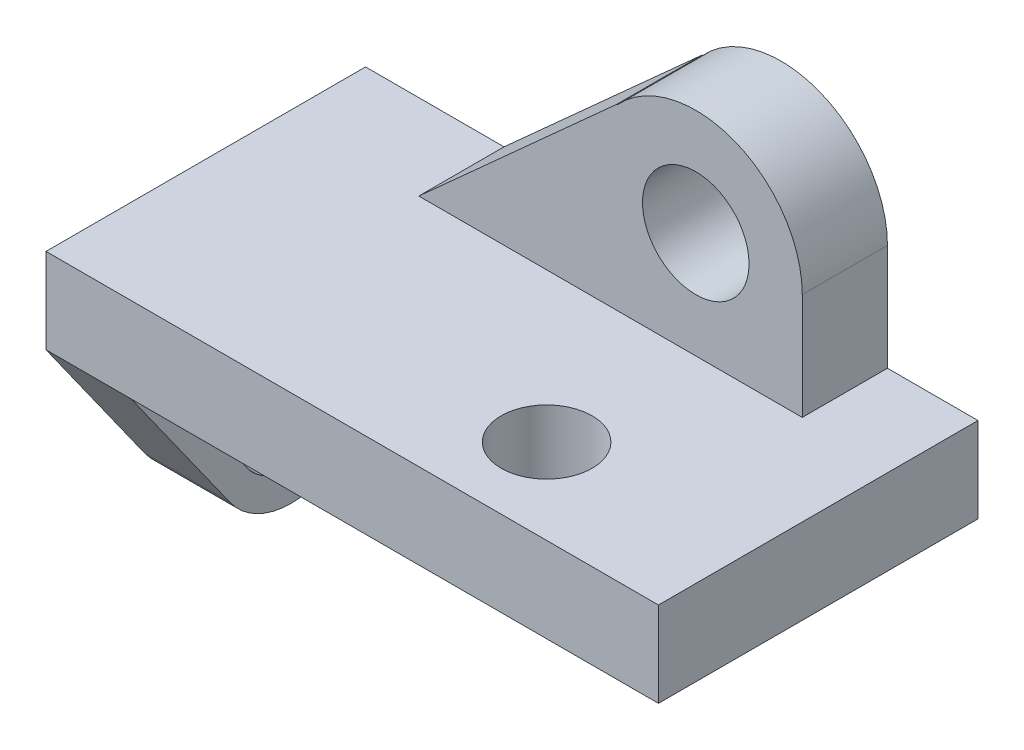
ISO-10303-21;
HEADER;
FILE_DESCRIPTION(('STEP AP214'),'2;1');
FILE_NAME('part.step','',(''),(''),'','','');
FILE_SCHEMA(('AUTOMOTIVE_DESIGN { 1 0 10303 214 1 1 1 1 }'));
ENDSEC;
DATA;
#1=APPLICATION_CONTEXT('core data for automotive mechanical design processes');
#2=APPLICATION_PROTOCOL_DEFINITION('international standard','automotive_design',2000,#1);
#3=PRODUCT_CONTEXT('',#1,'mechanical');
#4=PRODUCT('Part','Part','',(#3));
#5=PRODUCT_RELATED_PRODUCT_CATEGORY('part','',(#4));
#6=PRODUCT_DEFINITION_FORMATION('','',#4);
#7=PRODUCT_DEFINITION_CONTEXT('part definition',#1,'design');
#8=PRODUCT_DEFINITION('design','',#6,#7);
#9=PRODUCT_DEFINITION_SHAPE('','',#8);
#10=(LENGTH_UNIT() NAMED_UNIT(*) SI_UNIT(.MILLI.,.METRE.));
#11=(NAMED_UNIT(*) PLANE_ANGLE_UNIT() SI_UNIT($,.RADIAN.));
#12=(NAMED_UNIT(*) SI_UNIT($,.STERADIAN.) SOLID_ANGLE_UNIT());
#13=UNCERTAINTY_MEASURE_WITH_UNIT(LENGTH_MEASURE(1.E-05),#10,'distance_accuracy_value','');
#14=(GEOMETRIC_REPRESENTATION_CONTEXT(3) GLOBAL_UNCERTAINTY_ASSIGNED_CONTEXT((#13)) GLOBAL_UNIT_ASSIGNED_CONTEXT((#10,
#11,#12)) REPRESENTATION_CONTEXT('',''));
#15=CARTESIAN_POINT('',(0.,0.,0.));
#16=DIRECTION('',(0.,0.,1.));
#17=DIRECTION('',(1.,0.,0.));
#18=AXIS2_PLACEMENT_3D('',#15,#16,#17);
#19=CARTESIAN_POINT('',(-156.,32.,-60.));
#20=DIRECTION('',(1.,0.,0.));
#21=DIRECTION('',(0.,0.,-1.));
#22=AXIS2_PLACEMENT_3D('',#19,#20,#21);
#23=PLANE('',#22);
#24=DIRECTION('',(0.,-1.,0.));
#25=VECTOR('',#24,1.);
#26=CARTESIAN_POINT('',(-156.,32.,-60.));
#27=LINE('',#26,#25);
#28=CARTESIAN_POINT('',(-156.,32.,-60.));
#29=VERTEX_POINT('',#28);
#30=CARTESIAN_POINT('',(-156.,0.,-60.));
#31=VERTEX_POINT('',#30);
#32=EDGE_CURVE('E192',#29,#31,#27,.T.);
#33=ORIENTED_EDGE('',*,*,#32,.T.);
#34=DIRECTION('',(0.,-0.815119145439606,0.579293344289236));
#35=VECTOR('',#34,1.);
#36=CARTESIAN_POINT('',(-156.,-52.1676253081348,-22.9252259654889));
#37=LINE('',#36,#35);
#38=CARTESIAN_POINT('',(-156.,-52.1676253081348,-22.9252259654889));
#39=VERTEX_POINT('',#38);
#40=EDGE_CURVE('E445',#31,#39,#37,.T.);
#41=ORIENTED_EDGE('',*,*,#40,.T.);
#42=CARTESIAN_POINT('',(-156.,-35.875,0.));
#43=DIRECTION('',(-1.,0.,0.));
#44=DIRECTION('',(0.,0.,-1.));
#45=AXIS2_PLACEMENT_3D('',#42,#43,#44);
#46=CIRCLE('',#45,28.125);
#47=CARTESIAN_POINT('',(-156.,-52.1676253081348,22.9252259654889));
#48=VERTEX_POINT('',#47);
#49=EDGE_CURVE('E128',#39,#48,#46,.T.);
#50=ORIENTED_EDGE('',*,*,#49,.T.);
#51=DIRECTION('',(0.,0.815119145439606,0.579293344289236));
#52=VECTOR('',#51,1.);
#53=CARTESIAN_POINT('',(-156.,0.,60.));
#54=LINE('',#53,#52);
#55=CARTESIAN_POINT('',(-156.,0.,60.));
#56=VERTEX_POINT('',#55);
#57=EDGE_CURVE('E142',#48,#56,#54,.T.);
#58=ORIENTED_EDGE('',*,*,#57,.T.);
#59=DIRECTION('',(0.,-1.,0.));
#60=VECTOR('',#59,1.);
#61=CARTESIAN_POINT('',(-156.,32.,60.));
#62=LINE('',#61,#60);
#63=CARTESIAN_POINT('',(-156.,32.,60.));
#64=VERTEX_POINT('',#63);
#65=EDGE_CURVE('E11',#64,#56,#62,.T.);
#66=ORIENTED_EDGE('',*,*,#65,.F.);
#67=DIRECTION('',(0.,0.,1.));
#68=VECTOR('',#67,1.);
#69=CARTESIAN_POINT('',(-156.,32.,-60.));
#70=LINE('',#69,#68);
#71=EDGE_CURVE('E176',#29,#64,#70,.T.);
#72=ORIENTED_EDGE('',*,*,#71,.F.);
#73=EDGE_LOOP('',(#33,#41,#50,#58,#66,#72));
#74=FACE_BOUND('',#73,.T.);
#75=CARTESIAN_POINT('',(-156.,-32.,0.));
#76=DIRECTION('',(-1.,0.,0.));
#77=DIRECTION('',(0.,0.,1.));
#78=AXIS2_PLACEMENT_3D('',#75,#76,#77);
#79=CIRCLE('',#78,20.5525797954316);
#80=CARTESIAN_POINT('',(-156.,-32.,20.5525797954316));
#81=VERTEX_POINT('',#80);
#82=EDGE_CURVE('E438',#81,#81,#79,.T.);
#83=ORIENTED_EDGE('',*,*,#82,.F.);
#84=EDGE_LOOP('',(#83));
#85=FACE_BOUND('',#84,.T.);
#86=ADVANCED_FACE('F31',(#74,#85),#23,.F.);
#87=CARTESIAN_POINT('',(-156.,32.,60.));
#88=DIRECTION('',(0.,0.,-1.));
#89=DIRECTION('',(-1.,0.,0.));
#90=AXIS2_PLACEMENT_3D('',#87,#88,#89);
#91=PLANE('',#90);
#92=DIRECTION('',(1.,0.,0.));
#93=VECTOR('',#92,1.);
#94=CARTESIAN_POINT('',(-156.,0.,60.));
#95=LINE('',#94,#93);
#96=CARTESIAN_POINT('',(-124.,0.,60.));
#97=VERTEX_POINT('',#96);
#98=EDGE_CURVE('E182',#56,#97,#95,.T.);
#99=ORIENTED_EDGE('',*,*,#98,.T.);
#100=CARTESIAN_POINT('',(74.,0.,60.));
#101=VERTEX_POINT('',#100);
#102=EDGE_CURVE('E165',#97,#101,#95,.T.);
#103=ORIENTED_EDGE('',*,*,#102,.T.);
#104=DIRECTION('',(0.,-1.,0.));
#105=VECTOR('',#104,1.);
#106=CARTESIAN_POINT('',(74.,32.,60.));
#107=LINE('',#106,#105);
#108=CARTESIAN_POINT('',(74.,32.,60.));
#109=VERTEX_POINT('',#108);
#110=EDGE_CURVE('E39',#109,#101,#107,.T.);
#111=ORIENTED_EDGE('',*,*,#110,.F.);
#112=DIRECTION('',(1.,0.,0.));
#113=VECTOR('',#112,1.);
#114=CARTESIAN_POINT('',(-156.,32.,60.));
#115=LINE('',#114,#113);
#116=EDGE_CURVE('E180',#64,#109,#115,.T.);
#117=ORIENTED_EDGE('',*,*,#116,.F.);
#118=ORIENTED_EDGE('',*,*,#65,.T.);
#119=EDGE_LOOP('',(#99,#103,#111,#117,#118));
#120=FACE_BOUND('',#119,.T.);
#121=ADVANCED_FACE('F235',(#120),#91,.F.);
#122=CARTESIAN_POINT('',(74.,32.,-60.));
#123=DIRECTION('',(-1.,0.,0.));
#124=DIRECTION('',(0.,0.,1.));
#125=AXIS2_PLACEMENT_3D('',#122,#123,#124);
#126=PLANE('',#125);
#127=DIRECTION('',(0.,0.,-1.));
#128=VECTOR('',#127,1.);
#129=CARTESIAN_POINT('',(74.,0.,-60.));
#130=LINE('',#129,#128);
#131=CARTESIAN_POINT('',(74.,0.,-60.));
#132=VERTEX_POINT('',#131);
#133=EDGE_CURVE('E177',#101,#132,#130,.T.);
#134=ORIENTED_EDGE('',*,*,#133,.T.);
#135=DIRECTION('',(0.,-1.,0.));
#136=VECTOR('',#135,1.);
#137=CARTESIAN_POINT('',(74.,32.,-60.));
#138=LINE('',#137,#136);
#139=CARTESIAN_POINT('',(74.,32.,-60.));
#140=VERTEX_POINT('',#139);
#141=EDGE_CURVE('E175',#140,#132,#138,.T.);
#142=ORIENTED_EDGE('',*,*,#141,.F.);
#143=DIRECTION('',(0.,0.,-1.));
#144=VECTOR('',#143,1.);
#145=CARTESIAN_POINT('',(74.,32.,-60.));
#146=LINE('',#145,#144);
#147=EDGE_CURVE('E205',#109,#140,#146,.T.);
#148=ORIENTED_EDGE('',*,*,#147,.F.);
#149=ORIENTED_EDGE('',*,*,#110,.T.);
#150=EDGE_LOOP('',(#134,#142,#148,#149));
#151=FACE_BOUND('',#150,.T.);
#152=ADVANCED_FACE('F237',(#151),#126,.F.);
#153=CARTESIAN_POINT('',(-156.,32.,-60.));
#154=DIRECTION('',(0.,0.,1.));
#155=DIRECTION('',(1.,0.,0.));
#156=AXIS2_PLACEMENT_3D('',#153,#154,#155);
#157=PLANE('',#156);
#158=DIRECTION('',(-1.,0.,0.));
#159=VECTOR('',#158,1.);
#160=CARTESIAN_POINT('',(-156.,0.,-60.));
#161=LINE('',#160,#159);
#162=CARTESIAN_POINT('',(-124.,0.,-60.));
#163=VERTEX_POINT('',#162);
#164=EDGE_CURVE('E164',#132,#163,#161,.T.);
#165=ORIENTED_EDGE('',*,*,#164,.T.);
#166=DIRECTION('',(-1.,0.,0.));
#167=VECTOR('',#166,1.);
#168=CARTESIAN_POINT('',(-124.,0.,-60.));
#169=LINE('',#168,#167);
#170=EDGE_CURVE('E140',#163,#31,#169,.T.);
#171=ORIENTED_EDGE('',*,*,#170,.T.);
#172=ORIENTED_EDGE('',*,*,#32,.F.);
#173=DIRECTION('',(-1.,0.,0.));
#174=VECTOR('',#173,1.);
#175=CARTESIAN_POINT('',(-156.,32.,-60.));
#176=LINE('',#175,#174);
#177=CARTESIAN_POINT('',(-104.,32.,-60.));
#178=VERTEX_POINT('',#177);
#179=EDGE_CURVE('E201',#178,#29,#176,.T.);
#180=ORIENTED_EDGE('',*,*,#179,.F.);
#181=DIRECTION('',(-0.742771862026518,-0.669544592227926,0.));
#182=VECTOR('',#181,1.);
#183=CARTESIAN_POINT('',(-109.239378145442,27.2771537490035,-60.));
#184=LINE('',#183,#182);
#185=CARTESIAN_POINT('',(-29.6901707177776,98.9838841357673,-60.));
#186=VERTEX_POINT('',#185);
#187=EDGE_CURVE('E55',#186,#178,#184,.T.);
#188=ORIENTED_EDGE('',*,*,#187,.F.);
#189=DIRECTION('',(1.,0.,0.));
#190=VECTOR('',#189,1.);
#191=CARTESIAN_POINT('',(-29.4075769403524,98.9838841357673,-60.));
#192=LINE('',#191,#190);
#193=CARTESIAN_POINT('',(-29.4257279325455,98.9838841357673,-60.));
#194=VERTEX_POINT('',#193);
#195=EDGE_CURVE('E253',#186,#194,#192,.T.);
#196=ORIENTED_EDGE('',*,*,#195,.T.);
#197=CARTESIAN_POINT('',(0.0175364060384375,71.9340859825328,-60.));
#198=DIRECTION('',(0.,0.,1.));
#199=DIRECTION('',(1.,0.,0.));
#200=AXIS2_PLACEMENT_3D('',#197,#198,#199);
#201=CIRCLE('',#200,39.9824635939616);
#202=CARTESIAN_POINT('',(40.,71.9340859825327,-60.));
#203=VERTEX_POINT('',#202);
#204=EDGE_CURVE('E252',#203,#194,#201,.T.);
#205=ORIENTED_EDGE('',*,*,#204,.F.);
#206=DIRECTION('',(0.,1.,0.));
#207=VECTOR('',#206,1.);
#208=CARTESIAN_POINT('',(40.,-61.2857535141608,-60.));
#209=LINE('',#208,#207);
#210=CARTESIAN_POINT('',(40.,32.,-60.));
#211=VERTEX_POINT('',#210);
#212=EDGE_CURVE('E239',#211,#203,#209,.T.);
#213=ORIENTED_EDGE('',*,*,#212,.F.);
#214=EDGE_CURVE('E194',#140,#211,#176,.T.);
#215=ORIENTED_EDGE('',*,*,#214,.F.);
#216=ORIENTED_EDGE('',*,*,#141,.T.);
#217=EDGE_LOOP('',(#165,#171,#172,#180,#188,#196,#205,#213,#215,#216));
#218=FACE_BOUND('',#217,.T.);
#219=CARTESIAN_POINT('',(0.0175364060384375,71.9340859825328,-60.));
#220=DIRECTION('',(0.,0.,1.));
#221=DIRECTION('',(1.,0.,0.));
#222=AXIS2_PLACEMENT_3D('',#219,#220,#221);
#223=CIRCLE('',#222,20.);
#224=CARTESIAN_POINT('',(20.0175364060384,71.9340859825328,-60.));
#225=VERTEX_POINT('',#224);
#226=EDGE_CURVE('E153',#225,#225,#223,.T.);
#227=ORIENTED_EDGE('',*,*,#226,.T.);
#228=EDGE_LOOP('',(#227));
#229=FACE_BOUND('',#228,.T.);
#230=ADVANCED_FACE('F169',(#218,#229),#157,.F.);
#231=CARTESIAN_POINT('',(-156.,32.,60.));
#232=DIRECTION('',(0.,1.,0.));
#233=DIRECTION('',(0.,0.,1.));
#234=AXIS2_PLACEMENT_3D('',#231,#232,#233);
#235=PLANE('',#234);
#236=CARTESIAN_POINT('',(0.,32.,28.));
#237=DIRECTION('',(0.,1.,0.));
#238=DIRECTION('',(0.,0.,1.));
#239=AXIS2_PLACEMENT_3D('',#236,#237,#238);
#240=CIRCLE('',#239,17.0810187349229);
#241=CARTESIAN_POINT('',(0.,32.,45.0810187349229));
#242=VERTEX_POINT('',#241);
#243=EDGE_CURVE('E435',#242,#242,#240,.T.);
#244=ORIENTED_EDGE('',*,*,#243,.F.);
#245=EDGE_LOOP('',(#244));
#246=FACE_BOUND('',#245,.T.);
#247=DIRECTION('',(0.,0.,-1.));
#248=VECTOR('',#247,1.);
#249=CARTESIAN_POINT('',(40.,32.,-28.));
#250=LINE('',#249,#248);
#251=CARTESIAN_POINT('',(40.,32.,-28.));
#252=VERTEX_POINT('',#251);
#253=EDGE_CURVE('E240',#252,#211,#250,.T.);
#254=ORIENTED_EDGE('',*,*,#253,.F.);
#255=DIRECTION('',(1.,0.,0.));
#256=VECTOR('',#255,1.);
#257=CARTESIAN_POINT('',(-29.4075769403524,32.,-28.));
#258=LINE('',#257,#256);
#259=CARTESIAN_POINT('',(-104.,32.,-28.));
#260=VERTEX_POINT('',#259);
#261=EDGE_CURVE('E241',#260,#252,#258,.T.);
#262=ORIENTED_EDGE('',*,*,#261,.F.);
#263=DIRECTION('',(0.,0.,-1.));
#264=VECTOR('',#263,1.);
#265=CARTESIAN_POINT('',(-104.,32.,-28.));
#266=LINE('',#265,#264);
#267=EDGE_CURVE('E231',#260,#178,#266,.T.);
#268=ORIENTED_EDGE('',*,*,#267,.T.);
#269=ORIENTED_EDGE('',*,*,#179,.T.);
#270=ORIENTED_EDGE('',*,*,#71,.T.);
#271=ORIENTED_EDGE('',*,*,#116,.T.);
#272=ORIENTED_EDGE('',*,*,#147,.T.);
#273=ORIENTED_EDGE('',*,*,#214,.T.);
#274=EDGE_LOOP('',(#254,#262,#268,#269,#270,#271,#272,#273));
#275=FACE_BOUND('',#274,.T.);
#276=ADVANCED_FACE('F227',(#246,#275),#235,.T.);
#277=CARTESIAN_POINT('',(-156.,0.,60.));
#278=DIRECTION('',(0.,1.,0.));
#279=DIRECTION('',(0.,0.,1.));
#280=AXIS2_PLACEMENT_3D('',#277,#278,#279);
#281=PLANE('',#280);
#282=CARTESIAN_POINT('',(0.,0.,28.));
#283=DIRECTION('',(0.,1.,0.));
#284=DIRECTION('',(0.,0.,1.));
#285=AXIS2_PLACEMENT_3D('',#282,#283,#284);
#286=CIRCLE('',#285,17.0810187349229);
#287=CARTESIAN_POINT('',(0.,0.,45.0810187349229));
#288=VERTEX_POINT('',#287);
#289=EDGE_CURVE('E34',#288,#288,#286,.T.);
#290=ORIENTED_EDGE('',*,*,#289,.T.);
#291=EDGE_LOOP('',(#290));
#292=FACE_BOUND('',#291,.T.);
#293=ORIENTED_EDGE('',*,*,#102,.F.);
#294=DIRECTION('',(0.,0.,-1.));
#295=VECTOR('',#294,1.);
#296=CARTESIAN_POINT('',(-124.,0.,-60.));
#297=LINE('',#296,#295);
#298=EDGE_CURVE('E132',#97,#163,#297,.T.);
#299=ORIENTED_EDGE('',*,*,#298,.T.);
#300=ORIENTED_EDGE('',*,*,#164,.F.);
#301=ORIENTED_EDGE('',*,*,#133,.F.);
#302=EDGE_LOOP('',(#293,#299,#300,#301));
#303=FACE_BOUND('',#302,.T.);
#304=ADVANCED_FACE('F162',(#292,#303),#281,.F.);
#305=CARTESIAN_POINT('',(40.,-61.2857535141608,-28.));
#306=DIRECTION('',(-1.,0.,0.));
#307=DIRECTION('',(0.,-1.,0.));
#308=AXIS2_PLACEMENT_3D('',#305,#306,#307);
#309=PLANE('',#308);
#310=ORIENTED_EDGE('',*,*,#212,.T.);
#311=DIRECTION('',(0.,0.,-1.));
#312=VECTOR('',#311,1.);
#313=CARTESIAN_POINT('',(40.,71.9340859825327,-28.));
#314=LINE('',#313,#312);
#315=CARTESIAN_POINT('',(40.,71.9340859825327,-28.));
#316=VERTEX_POINT('',#315);
#317=EDGE_CURVE('E211',#316,#203,#314,.T.);
#318=ORIENTED_EDGE('',*,*,#317,.F.);
#319=DIRECTION('',(0.,1.,0.));
#320=VECTOR('',#319,1.);
#321=CARTESIAN_POINT('',(40.,-61.2857535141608,-28.));
#322=LINE('',#321,#320);
#323=EDGE_CURVE('E265',#252,#316,#322,.T.);
#324=ORIENTED_EDGE('',*,*,#323,.F.);
#325=ORIENTED_EDGE('',*,*,#253,.T.);
#326=EDGE_LOOP('',(#310,#318,#324,#325));
#327=FACE_BOUND('',#326,.T.);
#328=ADVANCED_FACE('F308',(#327),#309,.F.);
#329=CARTESIAN_POINT('',(0.0175364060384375,71.9340859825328,-28.));
#330=DIRECTION('',(0.,0.,-1.));
#331=DIRECTION('',(-1.,0.,0.));
#332=AXIS2_PLACEMENT_3D('',#329,#330,#331);
#333=CYLINDRICAL_SURFACE('',#332,39.9824635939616);
#334=ORIENTED_EDGE('',*,*,#204,.T.);
#335=DIRECTION('',(0.,0.,-1.));
#336=VECTOR('',#335,1.);
#337=CARTESIAN_POINT('',(-29.4257279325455,98.9838841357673,-28.));
#338=LINE('',#337,#336);
#339=CARTESIAN_POINT('',(-29.4257279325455,98.9838841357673,-28.));
#340=VERTEX_POINT('',#339);
#341=EDGE_CURVE('E214',#340,#194,#338,.T.);
#342=ORIENTED_EDGE('',*,*,#341,.F.);
#343=CARTESIAN_POINT('',(0.0175364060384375,71.9340859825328,-28.));
#344=DIRECTION('',(0.,0.,1.));
#345=DIRECTION('',(1.,0.,0.));
#346=AXIS2_PLACEMENT_3D('',#343,#344,#345);
#347=CIRCLE('',#346,39.9824635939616);
#348=EDGE_CURVE('E270',#316,#340,#347,.T.);
#349=ORIENTED_EDGE('',*,*,#348,.F.);
#350=ORIENTED_EDGE('',*,*,#317,.T.);
#351=EDGE_LOOP('',(#334,#342,#349,#350));
#352=FACE_BOUND('',#351,.T.);
#353=ADVANCED_FACE('F291',(#352),#333,.T.);
#354=CARTESIAN_POINT('',(-29.4075769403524,98.9838841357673,-28.));
#355=DIRECTION('',(0.,1.,0.));
#356=DIRECTION('',(0.,0.,1.));
#357=AXIS2_PLACEMENT_3D('',#354,#355,#356);
#358=PLANE('',#357);
#359=ORIENTED_EDGE('',*,*,#195,.F.);
#360=DIRECTION('',(0.,0.,-1.));
#361=VECTOR('',#360,1.);
#362=CARTESIAN_POINT('',(-29.6901707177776,98.9838841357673,-28.));
#363=LINE('',#362,#361);
#364=CARTESIAN_POINT('',(-29.6901707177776,98.9838841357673,-28.));
#365=VERTEX_POINT('',#364);
#366=EDGE_CURVE('E220',#365,#186,#363,.T.);
#367=ORIENTED_EDGE('',*,*,#366,.F.);
#368=DIRECTION('',(1.,0.,0.));
#369=VECTOR('',#368,1.);
#370=CARTESIAN_POINT('',(-29.4075769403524,98.9838841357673,-28.));
#371=LINE('',#370,#369);
#372=EDGE_CURVE('E275',#365,#340,#371,.T.);
#373=ORIENTED_EDGE('',*,*,#372,.T.);
#374=ORIENTED_EDGE('',*,*,#341,.T.);
#375=EDGE_LOOP('',(#359,#367,#373,#374));
#376=FACE_BOUND('',#375,.T.);
#377=ADVANCED_FACE('F284',(#376),#358,.T.);
#378=CARTESIAN_POINT('',(-109.239378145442,27.2771537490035,-28.));
#379=DIRECTION('',(0.669544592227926,-0.742771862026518,0.));
#380=DIRECTION('',(0.742771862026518,0.669544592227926,0.));
#381=AXIS2_PLACEMENT_3D('',#378,#379,#380);
#382=PLANE('',#381);
#383=ORIENTED_EDGE('',*,*,#187,.T.);
#384=ORIENTED_EDGE('',*,*,#267,.F.);
#385=DIRECTION('',(-0.742771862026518,-0.669544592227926,0.));
#386=VECTOR('',#385,1.);
#387=CARTESIAN_POINT('',(-109.239378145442,27.2771537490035,-28.));
#388=LINE('',#387,#386);
#389=EDGE_CURVE('E245',#365,#260,#388,.T.);
#390=ORIENTED_EDGE('',*,*,#389,.F.);
#391=ORIENTED_EDGE('',*,*,#366,.T.);
#392=EDGE_LOOP('',(#383,#384,#390,#391));
#393=FACE_BOUND('',#392,.T.);
#394=ADVANCED_FACE('F281',(#393),#382,.F.);
#395=CARTESIAN_POINT('',(0.0175364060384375,71.9340859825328,-28.));
#396=DIRECTION('',(0.,0.,-1.));
#397=DIRECTION('',(-1.,0.,0.));
#398=AXIS2_PLACEMENT_3D('',#395,#396,#397);
#399=CYLINDRICAL_SURFACE('',#398,20.);
#400=CARTESIAN_POINT('',(0.0175364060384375,71.9340859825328,-28.));
#401=DIRECTION('',(0.,0.,1.));
#402=DIRECTION('',(1.,0.,0.));
#403=AXIS2_PLACEMENT_3D('',#400,#401,#402);
#404=CIRCLE('',#403,20.);
#405=CARTESIAN_POINT('',(20.0175364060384,71.9340859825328,-28.));
#406=VERTEX_POINT('',#405);
#407=EDGE_CURVE('E263',#406,#406,#404,.T.);
#408=ORIENTED_EDGE('',*,*,#407,.T.);
#409=EDGE_LOOP('',(#408));
#410=FACE_BOUND('',#409,.T.);
#411=ORIENTED_EDGE('',*,*,#226,.F.);
#412=EDGE_LOOP('',(#411));
#413=FACE_BOUND('',#412,.T.);
#414=ADVANCED_FACE('F283',(#410,#413),#399,.F.);
#415=CARTESIAN_POINT('',(-29.4075769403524,-61.2857535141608,-28.));
#416=DIRECTION('',(0.,0.,1.));
#417=DIRECTION('',(1.,0.,0.));
#418=AXIS2_PLACEMENT_3D('',#415,#416,#417);
#419=PLANE('',#418);
#420=ORIENTED_EDGE('',*,*,#407,.F.);
#421=EDGE_LOOP('',(#420));
#422=FACE_BOUND('',#421,.T.);
#423=ORIENTED_EDGE('',*,*,#323,.T.);
#424=ORIENTED_EDGE('',*,*,#348,.T.);
#425=ORIENTED_EDGE('',*,*,#372,.F.);
#426=ORIENTED_EDGE('',*,*,#389,.T.);
#427=ORIENTED_EDGE('',*,*,#261,.T.);
#428=EDGE_LOOP('',(#423,#424,#425,#426,#427));
#429=FACE_BOUND('',#428,.T.);
#430=ADVANCED_FACE('F280',(#422,#429),#419,.T.);
#431=CARTESIAN_POINT('',(-124.,-52.1676253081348,-22.9252259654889));
#432=DIRECTION('',(0.,-0.579293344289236,-0.815119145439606));
#433=DIRECTION('',(0.,0.815119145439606,-0.579293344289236));
#434=AXIS2_PLACEMENT_3D('',#431,#432,#433);
#435=PLANE('',#434);
#436=ORIENTED_EDGE('',*,*,#40,.F.);
#437=ORIENTED_EDGE('',*,*,#170,.F.);
#438=DIRECTION('',(0.,-0.815119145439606,0.579293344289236));
#439=VECTOR('',#438,1.);
#440=CARTESIAN_POINT('',(-124.,-52.1676253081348,-22.9252259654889));
#441=LINE('',#440,#439);
#442=CARTESIAN_POINT('',(-124.,-52.1676253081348,-22.9252259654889));
#443=VERTEX_POINT('',#442);
#444=EDGE_CURVE('E47',#163,#443,#441,.T.);
#445=ORIENTED_EDGE('',*,*,#444,.T.);
#446=DIRECTION('',(-1.,0.,0.));
#447=VECTOR('',#446,1.);
#448=CARTESIAN_POINT('',(-124.,-52.1676253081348,-22.9252259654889));
#449=LINE('',#448,#447);
#450=EDGE_CURVE('E124',#443,#39,#449,.T.);
#451=ORIENTED_EDGE('',*,*,#450,.T.);
#452=EDGE_LOOP('',(#436,#437,#445,#451));
#453=FACE_BOUND('',#452,.T.);
#454=ADVANCED_FACE('F138',(#453),#435,.T.);
#455=CARTESIAN_POINT('',(-124.,0.,60.));
#456=DIRECTION('',(0.,-0.579293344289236,0.815119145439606));
#457=DIRECTION('',(0.,-0.815119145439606,-0.579293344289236));
#458=AXIS2_PLACEMENT_3D('',#455,#456,#457);
#459=PLANE('',#458);
#460=ORIENTED_EDGE('',*,*,#57,.F.);
#461=DIRECTION('',(-1.,0.,0.));
#462=VECTOR('',#461,1.);
#463=CARTESIAN_POINT('',(-124.,-52.1676253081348,22.9252259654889));
#464=LINE('',#463,#462);
#465=CARTESIAN_POINT('',(-124.,-52.1676253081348,22.9252259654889));
#466=VERTEX_POINT('',#465);
#467=EDGE_CURVE('E131',#466,#48,#464,.T.);
#468=ORIENTED_EDGE('',*,*,#467,.F.);
#469=DIRECTION('',(0.,0.815119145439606,0.579293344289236));
#470=VECTOR('',#469,1.);
#471=CARTESIAN_POINT('',(-124.,0.,60.));
#472=LINE('',#471,#470);
#473=EDGE_CURVE('E136',#466,#97,#472,.T.);
#474=ORIENTED_EDGE('',*,*,#473,.T.);
#475=ORIENTED_EDGE('',*,*,#98,.F.);
#476=EDGE_LOOP('',(#460,#468,#474,#475));
#477=FACE_BOUND('',#476,.T.);
#478=ADVANCED_FACE('F372',(#477),#459,.T.);
#479=CARTESIAN_POINT('',(-124.,-35.875,0.));
#480=DIRECTION('',(-1.,0.,0.));
#481=DIRECTION('',(0.,0.,1.));
#482=AXIS2_PLACEMENT_3D('',#479,#480,#481);
#483=CYLINDRICAL_SURFACE('',#482,28.125);
#484=ORIENTED_EDGE('',*,*,#49,.F.);
#485=ORIENTED_EDGE('',*,*,#450,.F.);
#486=CARTESIAN_POINT('',(-124.,-35.875,0.));
#487=DIRECTION('',(-1.,0.,0.));
#488=DIRECTION('',(0.,0.,-1.));
#489=AXIS2_PLACEMENT_3D('',#486,#487,#488);
#490=CIRCLE('',#489,28.125);
#491=EDGE_CURVE('E126',#443,#466,#490,.T.);
#492=ORIENTED_EDGE('',*,*,#491,.T.);
#493=ORIENTED_EDGE('',*,*,#467,.T.);
#494=EDGE_LOOP('',(#484,#485,#492,#493));
#495=FACE_BOUND('',#494,.T.);
#496=ADVANCED_FACE('F125',(#495),#483,.T.);
#497=CARTESIAN_POINT('',(-124.,-35.875,0.));
#498=DIRECTION('',(1.,0.,0.));
#499=DIRECTION('',(0.,0.,-1.));
#500=AXIS2_PLACEMENT_3D('',#497,#498,#499);
#501=PLANE('',#500);
#502=CARTESIAN_POINT('',(-124.,-32.,0.));
#503=DIRECTION('',(-1.,0.,0.));
#504=DIRECTION('',(0.,0.,1.));
#505=AXIS2_PLACEMENT_3D('',#502,#503,#504);
#506=CIRCLE('',#505,20.5525797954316);
#507=CARTESIAN_POINT('',(-124.,-32.,20.5525797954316));
#508=VERTEX_POINT('',#507);
#509=EDGE_CURVE('E440',#508,#508,#506,.T.);
#510=ORIENTED_EDGE('',*,*,#509,.T.);
#511=EDGE_LOOP('',(#510));
#512=FACE_BOUND('',#511,.T.);
#513=ORIENTED_EDGE('',*,*,#444,.F.);
#514=ORIENTED_EDGE('',*,*,#298,.F.);
#515=ORIENTED_EDGE('',*,*,#473,.F.);
#516=ORIENTED_EDGE('',*,*,#491,.F.);
#517=EDGE_LOOP('',(#513,#514,#515,#516));
#518=FACE_BOUND('',#517,.T.);
#519=ADVANCED_FACE('F135',(#512,#518),#501,.T.);
#520=CARTESIAN_POINT('',(-124.,-32.,0.));
#521=DIRECTION('',(-1.,0.,0.));
#522=DIRECTION('',(0.,0.,1.));
#523=AXIS2_PLACEMENT_3D('',#520,#521,#522);
#524=CYLINDRICAL_SURFACE('',#523,20.5525797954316);
#525=ORIENTED_EDGE('',*,*,#509,.F.);
#526=EDGE_LOOP('',(#525));
#527=FACE_BOUND('',#526,.T.);
#528=ORIENTED_EDGE('',*,*,#82,.T.);
#529=EDGE_LOOP('',(#528));
#530=FACE_BOUND('',#529,.T.);
#531=ADVANCED_FACE('F397',(#527,#530),#524,.F.);
#532=CARTESIAN_POINT('',(0.,-64.,28.));
#533=DIRECTION('',(0.,1.,0.));
#534=DIRECTION('',(0.,0.,1.));
#535=AXIS2_PLACEMENT_3D('',#532,#533,#534);
#536=CYLINDRICAL_SURFACE('',#535,17.0810187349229);
#537=ORIENTED_EDGE('',*,*,#243,.T.);
#538=EDGE_LOOP('',(#537));
#539=FACE_BOUND('',#538,.T.);
#540=ORIENTED_EDGE('',*,*,#289,.F.);
#541=EDGE_LOOP('',(#540));
#542=FACE_BOUND('',#541,.T.);
#543=ADVANCED_FACE('F407',(#539,#542),#536,.F.);
#544=CLOSED_SHELL('',(#86,#121,#152,#230,#276,#304,#328,#353,#377,#394,#414,#430,#454,#478,#496,
#519,#531,#543));
#545=MANIFOLD_SOLID_BREP('B2',#544);
#546=ADVANCED_BREP_SHAPE_REPRESENTATION('',(#18,#545),#14);
#547=SHAPE_DEFINITION_REPRESENTATION(#9,#546);
ENDSEC;
END-ISO-10303-21;
